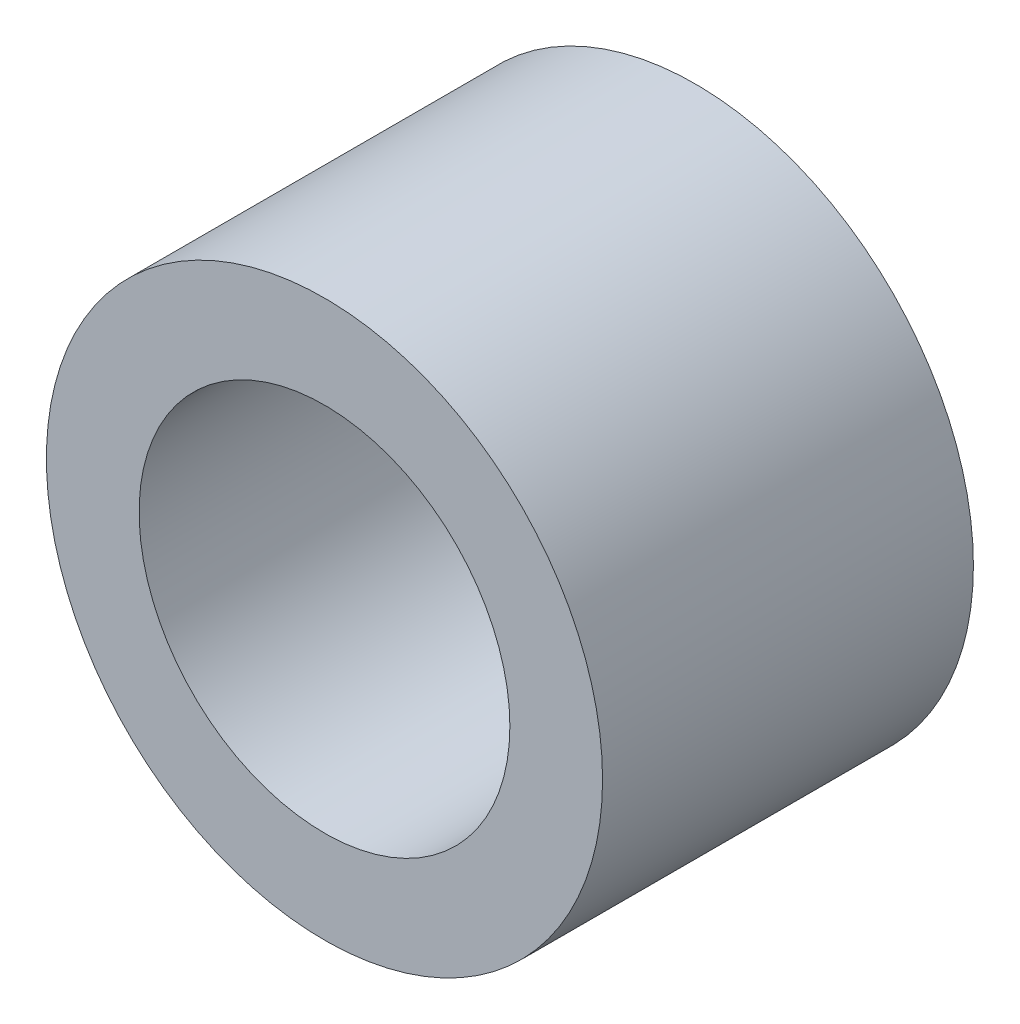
ISO-10303-21;
HEADER;
FILE_DESCRIPTION(('STEP AP214'),'2;1');
FILE_NAME('part.step','',(''),(''),'','','');
FILE_SCHEMA(('AUTOMOTIVE_DESIGN { 1 0 10303 214 1 1 1 1 }'));
ENDSEC;
DATA;
#1=APPLICATION_CONTEXT('core data for automotive mechanical design processes');
#2=APPLICATION_PROTOCOL_DEFINITION('international standard','automotive_design',2000,#1);
#3=PRODUCT_CONTEXT('',#1,'mechanical');
#4=PRODUCT('Part','Part','',(#3));
#5=PRODUCT_RELATED_PRODUCT_CATEGORY('part','',(#4));
#6=PRODUCT_DEFINITION_FORMATION('','',#4);
#7=PRODUCT_DEFINITION_CONTEXT('part definition',#1,'design');
#8=PRODUCT_DEFINITION('design','',#6,#7);
#9=PRODUCT_DEFINITION_SHAPE('','',#8);
#10=(LENGTH_UNIT() NAMED_UNIT(*) SI_UNIT(.MILLI.,.METRE.));
#11=(NAMED_UNIT(*) PLANE_ANGLE_UNIT() SI_UNIT($,.RADIAN.));
#12=(NAMED_UNIT(*) SI_UNIT($,.STERADIAN.) SOLID_ANGLE_UNIT());
#13=UNCERTAINTY_MEASURE_WITH_UNIT(LENGTH_MEASURE(1.E-05),#10,'distance_accuracy_value','');
#14=(GEOMETRIC_REPRESENTATION_CONTEXT(3) GLOBAL_UNCERTAINTY_ASSIGNED_CONTEXT((#13)) GLOBAL_UNIT_ASSIGNED_CONTEXT((#10,
#11,#12)) REPRESENTATION_CONTEXT('',''));
#15=CARTESIAN_POINT('',(0.,0.,0.));
#16=DIRECTION('',(0.,0.,1.));
#17=DIRECTION('',(1.,0.,0.));
#18=AXIS2_PLACEMENT_3D('',#15,#16,#17);
#19=CARTESIAN_POINT('',(0.,0.,-13.1025021));
#20=DIRECTION('',(0.,0.,1.));
#21=DIRECTION('',(1.,0.,0.));
#22=AXIS2_PLACEMENT_3D('',#19,#20,#21);
#23=CYLINDRICAL_SURFACE('',#22,9.825);
#24=CARTESIAN_POINT('',(0.,0.,-13.1025021));
#25=DIRECTION('',(0.,0.,1.));
#26=DIRECTION('',(1.,0.,0.));
#27=AXIS2_PLACEMENT_3D('',#24,#25,#26);
#28=CIRCLE('',#27,9.825);
#29=CARTESIAN_POINT('',(9.825,0.,-13.1025021));
#30=VERTEX_POINT('',#29);
#31=EDGE_CURVE('E10',#30,#30,#28,.T.);
#32=ORIENTED_EDGE('',*,*,#31,.T.);
#33=EDGE_LOOP('',(#32));
#34=FACE_BOUND('',#33,.T.);
#35=CARTESIAN_POINT('',(0.,0.,0.));
#36=DIRECTION('',(0.,0.,1.));
#37=DIRECTION('',(1.,0.,0.));
#38=AXIS2_PLACEMENT_3D('',#35,#36,#37);
#39=CIRCLE('',#38,9.825);
#40=CARTESIAN_POINT('',(9.825,0.,0.));
#41=VERTEX_POINT('',#40);
#42=EDGE_CURVE('E46',#41,#41,#39,.F.);
#43=ORIENTED_EDGE('',*,*,#42,.T.);
#44=EDGE_LOOP('',(#43));
#45=FACE_BOUND('',#44,.T.);
#46=ADVANCED_FACE('F35',(#34,#45),#23,.T.);
#47=CARTESIAN_POINT('',(0.,0.,-13.1025021));
#48=DIRECTION('',(0.,0.,1.));
#49=DIRECTION('',(1.,0.,0.));
#50=AXIS2_PLACEMENT_3D('',#47,#48,#49);
#51=CYLINDRICAL_SURFACE('',#50,6.55);
#52=CARTESIAN_POINT('',(0.,0.,-13.1025021));
#53=DIRECTION('',(0.,0.,1.));
#54=DIRECTION('',(1.,0.,0.));
#55=AXIS2_PLACEMENT_3D('',#52,#53,#54);
#56=CIRCLE('',#55,6.55);
#57=CARTESIAN_POINT('',(6.55,0.,-13.1025021));
#58=VERTEX_POINT('',#57);
#59=EDGE_CURVE('E42',#58,#58,#56,.T.);
#60=ORIENTED_EDGE('',*,*,#59,.F.);
#61=EDGE_LOOP('',(#60));
#62=FACE_BOUND('',#61,.T.);
#63=CARTESIAN_POINT('',(0.,0.,0.));
#64=DIRECTION('',(0.,0.,1.));
#65=DIRECTION('',(1.,0.,0.));
#66=AXIS2_PLACEMENT_3D('',#63,#64,#65);
#67=CIRCLE('',#66,6.55);
#68=CARTESIAN_POINT('',(6.55,0.,0.));
#69=VERTEX_POINT('',#68);
#70=EDGE_CURVE('E38',#69,#69,#67,.F.);
#71=ORIENTED_EDGE('',*,*,#70,.F.);
#72=EDGE_LOOP('',(#71));
#73=FACE_BOUND('',#72,.T.);
#74=ADVANCED_FACE('F57',(#62,#73),#51,.F.);
#75=CARTESIAN_POINT('',(0.,0.,-13.1025021));
#76=DIRECTION('',(0.,0.,1.));
#77=DIRECTION('',(1.,0.,0.));
#78=AXIS2_PLACEMENT_3D('',#75,#76,#77);
#79=PLANE('',#78);
#80=ORIENTED_EDGE('',*,*,#59,.T.);
#81=EDGE_LOOP('',(#80));
#82=FACE_BOUND('',#81,.T.);
#83=ORIENTED_EDGE('',*,*,#31,.F.);
#84=EDGE_LOOP('',(#83));
#85=FACE_BOUND('',#84,.T.);
#86=ADVANCED_FACE('F59',(#82,#85),#79,.F.);
#87=CARTESIAN_POINT('',(0.,0.,0.));
#88=DIRECTION('',(0.,0.,1.));
#89=DIRECTION('',(1.,0.,0.));
#90=AXIS2_PLACEMENT_3D('',#87,#88,#89);
#91=PLANE('',#90);
#92=ORIENTED_EDGE('',*,*,#42,.F.);
#93=EDGE_LOOP('',(#92));
#94=FACE_BOUND('',#93,.T.);
#95=ORIENTED_EDGE('',*,*,#70,.T.);
#96=EDGE_LOOP('',(#95));
#97=FACE_BOUND('',#96,.T.);
#98=ADVANCED_FACE('F55',(#94,#97),#91,.T.);
#99=CLOSED_SHELL('',(#46,#74,#86,#98));
#100=MANIFOLD_SOLID_BREP('B2',#99);
#101=ADVANCED_BREP_SHAPE_REPRESENTATION('',(#18,#100),#14);
#102=SHAPE_DEFINITION_REPRESENTATION(#9,#101);
ENDSEC;
END-ISO-10303-21;
